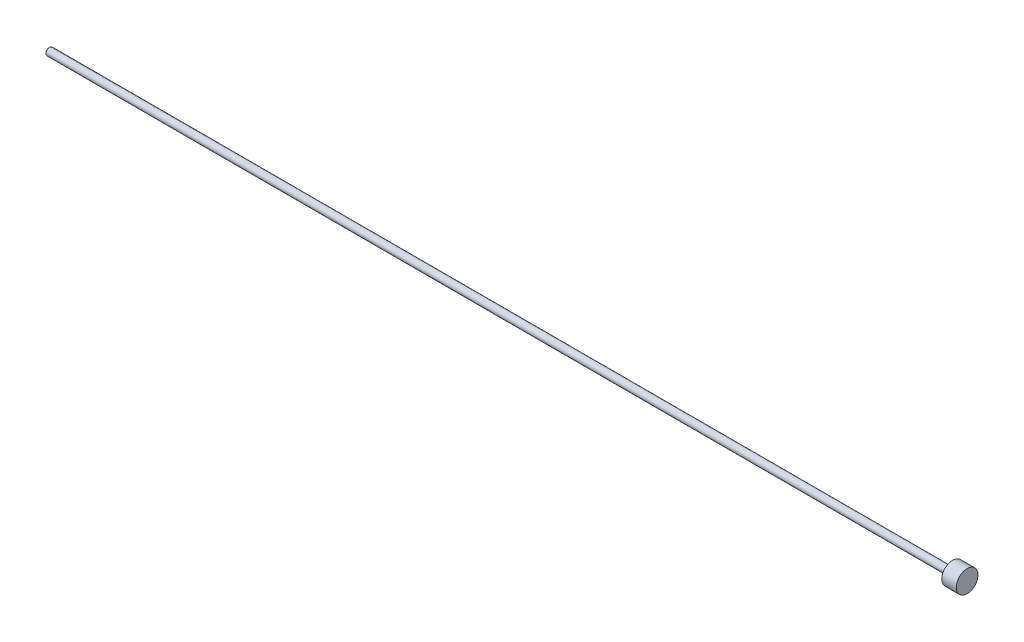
from build123d import *

# Parameters (mm, degrees)
SKETCH2_R               = 3.175
MAIN_BODY_DEPTH         = 803.2115
SKETCH3_R               = 9.525
PISTON_SIMULATION_DEPTH = 12.7
CHAMFER1_SIZE           = 0.508


with BuildPart() as part:
    # Sketch2 → Main_body (new body)
    with BuildSketch(Plane.ZY.offset(-1130.085360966)):
        with Locations(Location((0, 0, 0), (0, 0, 180))):
            Circle(SKETCH2_R)
    extrude(amount=MAIN_BODY_DEPTH)

    # Sketch3 → Piston Simulation (add)
    with BuildSketch(Plane.ZY.offset(-1130.085360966)):
        Circle(SKETCH3_R)
    extrude(amount=PISTON_SIMULATION_DEPTH)

    # Chamfer1
    chamfer1_edges = [part.edges().sort_by_distance(p)[0] for p in [
        (326.873860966, 0, 3.175),
    ]]
    chamfer(chamfer1_edges, length=CHAMFER1_SIZE)


solid = part.part
